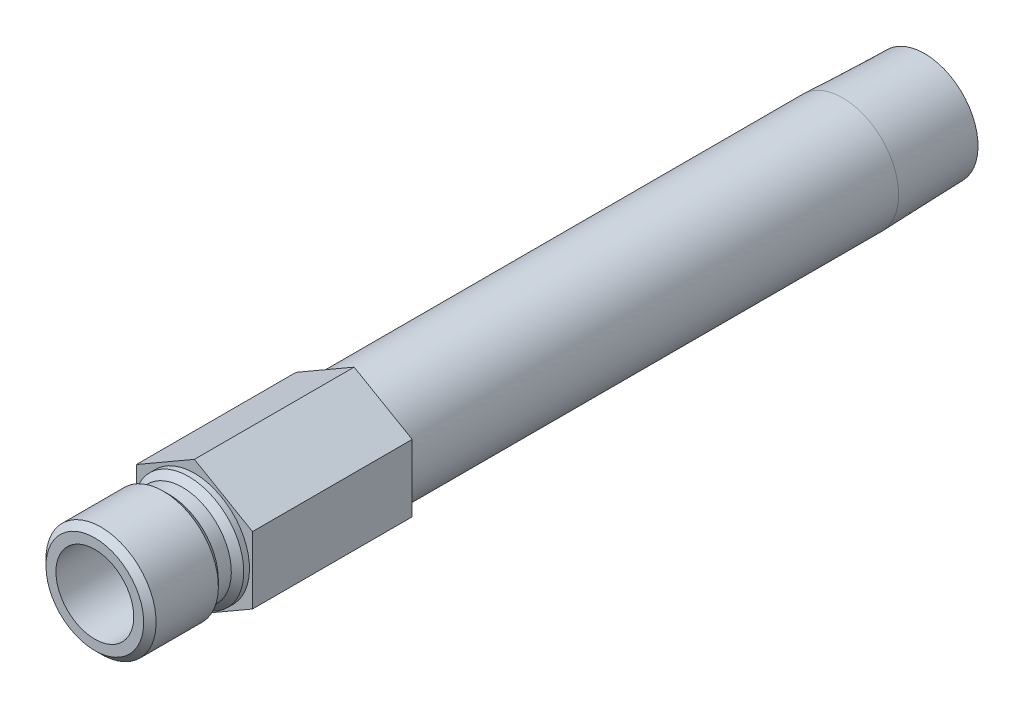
from build123d import *

# Parameters (mm, degrees)
SKETCH2_R           = 4.6228
BOSS_EXTRUDE1_DEPTH = 19.558


with BuildPart() as part:
    # Sketch1 → Revolve1 (revolve)
    with BuildSketch(Plane(origin=(0, 0, 0), x_dir=(0, 0, -1), z_dir=(1, 0, 0))):
        Polygon((-12.192, 4.7625), (-12.192, 5.9817), (-11.43, 6.7437), (-3.81, 6.7437), (-3.048, 5.9817), (-1.4605, 5.9817), (-0.6985, 6.7437), (0, 6.7437), (0, 6.858), (79.375, 6.858), (89.408, 6.544470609), (89.408, 4.6228), (0.074279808, 4.6228), (0, 4.7625), align=None)
    revolve(axis=Axis((0, 0, 0), (0, 0, 1)))

    # Sketch2 → Boss-Extrude1 (add)
    with BuildSketch(Plane.XY):
        Polygon((-7.112, 4.106115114), (-7.112, -4.106115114), (0, -8.212230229), (7.112, -4.106115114), (7.112, 4.106115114), (0, 8.212230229), align=None)
        with Locations(Location((0, 0, 0), (0, 0, 90))):
            Circle(SKETCH2_R, mode=Mode.SUBTRACT)
    extrude(amount=-BOSS_EXTRUDE1_DEPTH)


solid = part.part
